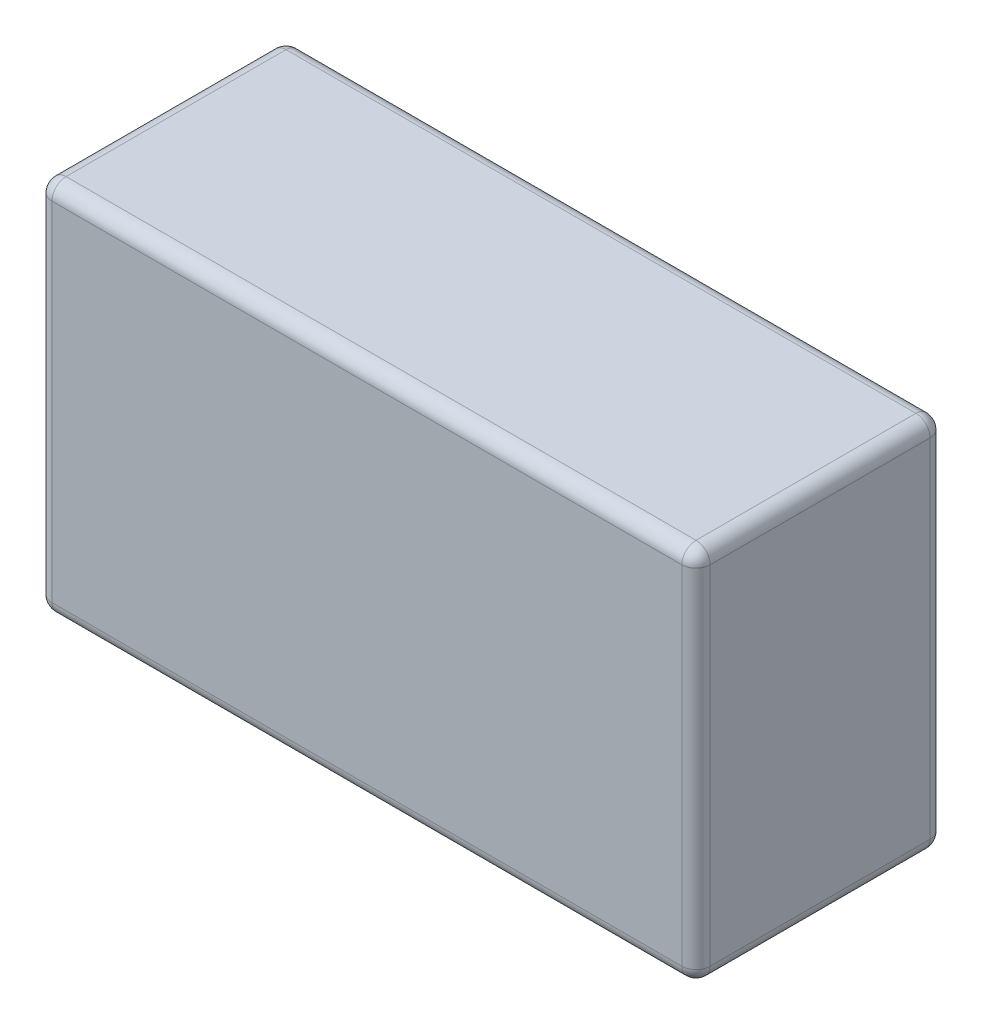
ISO-10303-21;
HEADER;
FILE_DESCRIPTION(('STEP AP214'),'2;1');
FILE_NAME('part.step','',(''),(''),'','','');
FILE_SCHEMA(('AUTOMOTIVE_DESIGN { 1 0 10303 214 1 1 1 1 }'));
ENDSEC;
DATA;
#1=APPLICATION_CONTEXT('core data for automotive mechanical design processes');
#2=APPLICATION_PROTOCOL_DEFINITION('international standard','automotive_design',2000,#1);
#3=PRODUCT_CONTEXT('',#1,'mechanical');
#4=PRODUCT('Part','Part','',(#3));
#5=PRODUCT_RELATED_PRODUCT_CATEGORY('part','',(#4));
#6=PRODUCT_DEFINITION_FORMATION('','',#4);
#7=PRODUCT_DEFINITION_CONTEXT('part definition',#1,'design');
#8=PRODUCT_DEFINITION('design','',#6,#7);
#9=PRODUCT_DEFINITION_SHAPE('','',#8);
#10=(LENGTH_UNIT() NAMED_UNIT(*) SI_UNIT(.MILLI.,.METRE.));
#11=(NAMED_UNIT(*) PLANE_ANGLE_UNIT() SI_UNIT($,.RADIAN.));
#12=(NAMED_UNIT(*) SI_UNIT($,.STERADIAN.) SOLID_ANGLE_UNIT());
#13=UNCERTAINTY_MEASURE_WITH_UNIT(LENGTH_MEASURE(1.E-05),#10,'distance_accuracy_value','');
#14=(GEOMETRIC_REPRESENTATION_CONTEXT(3) GLOBAL_UNCERTAINTY_ASSIGNED_CONTEXT((#13)) GLOBAL_UNIT_ASSIGNED_CONTEXT((#10,
#11,#12)) REPRESENTATION_CONTEXT('',''));
#15=CARTESIAN_POINT('',(0.,0.,0.));
#16=DIRECTION('',(0.,0.,1.));
#17=DIRECTION('',(1.,0.,0.));
#18=AXIS2_PLACEMENT_3D('',#15,#16,#17);
#19=CARTESIAN_POINT('',(0.,0.,17.5));
#20=DIRECTION('',(1.,0.,0.));
#21=DIRECTION('',(0.,0.,-1.));
#22=AXIS2_PLACEMENT_3D('',#19,#20,#21);
#23=PLANE('',#22);
#24=DIRECTION('',(0.,-1.,0.));
#25=VECTOR('',#24,1.);
#26=CARTESIAN_POINT('',(0.,0.,1.));
#27=LINE('',#26,#25);
#28=CARTESIAN_POINT('',(0.,25.5,1.));
#29=VERTEX_POINT('',#28);
#30=CARTESIAN_POINT('',(0.,1.,1.));
#31=VERTEX_POINT('',#30);
#32=EDGE_CURVE('E55',#29,#31,#27,.T.);
#33=ORIENTED_EDGE('',*,*,#32,.T.);
#34=DIRECTION('',(0.,0.,-1.));
#35=VECTOR('',#34,1.);
#36=CARTESIAN_POINT('',(0.,1.,17.5));
#37=LINE('',#36,#35);
#38=CARTESIAN_POINT('',(0.,1.,16.5));
#39=VERTEX_POINT('',#38);
#40=EDGE_CURVE('E11',#31,#39,#37,.F.);
#41=ORIENTED_EDGE('',*,*,#40,.T.);
#42=DIRECTION('',(0.,-1.,0.));
#43=VECTOR('',#42,1.);
#44=CARTESIAN_POINT('',(0.,0.,16.5));
#45=LINE('',#44,#43);
#46=CARTESIAN_POINT('',(0.,25.5,16.5));
#47=VERTEX_POINT('',#46);
#48=EDGE_CURVE('E310',#39,#47,#45,.F.);
#49=ORIENTED_EDGE('',*,*,#48,.T.);
#50=DIRECTION('',(0.,0.,-1.));
#51=VECTOR('',#50,1.);
#52=CARTESIAN_POINT('',(0.,25.5,17.5));
#53=LINE('',#52,#51);
#54=EDGE_CURVE('E307',#47,#29,#53,.T.);
#55=ORIENTED_EDGE('',*,*,#54,.T.);
#56=EDGE_LOOP('',(#33,#41,#49,#55));
#57=FACE_BOUND('',#56,.T.);
#58=DIRECTION('',(0.,-0.0147140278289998,0.999891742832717));
#59=VECTOR('',#58,1.);
#60=CARTESIAN_POINT('',(0.,3.58011191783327,6.48787112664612));
#61=LINE('',#60,#59);
#62=CARTESIAN_POINT('',(0.,3.58011191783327,6.48787112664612));
#63=VERTEX_POINT('',#62);
#64=CARTESIAN_POINT('',(0.,3.52064588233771,10.5288854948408));
#65=VERTEX_POINT('',#64);
#66=EDGE_CURVE('E173',#63,#65,#61,.T.);
#67=ORIENTED_EDGE('',*,*,#66,.F.);
#68=DIRECTION('',(0.,-0.873288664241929,0.487203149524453));
#69=VECTOR('',#68,1.);
#70=CARTESIAN_POINT('',(0.,7.10946603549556,4.51886303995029));
#71=LINE('',#70,#69);
#72=CARTESIAN_POINT('',(0.,7.10946603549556,4.51886303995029));
#73=VERTEX_POINT('',#72);
#74=EDGE_CURVE('E176',#73,#63,#71,.T.);
#75=ORIENTED_EDGE('',*,*,#74,.F.);
#76=DIRECTION('',(0.,-0.85857463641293,-0.512688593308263));
#77=VECTOR('',#76,1.);
#78=CARTESIAN_POINT('',(0.,10.5793541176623,6.59086932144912));
#79=LINE('',#78,#77);
#80=CARTESIAN_POINT('',(0.,10.5793541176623,6.59086932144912));
#81=VERTEX_POINT('',#80);
#82=EDGE_CURVE('E197',#81,#73,#79,.T.);
#83=ORIENTED_EDGE('',*,*,#82,.F.);
#84=DIRECTION('',(0.,0.0147140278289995,-0.999891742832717));
#85=VECTOR('',#84,1.);
#86=CARTESIAN_POINT('',(0.,10.5198880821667,10.6318836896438));
#87=LINE('',#86,#85);
#88=CARTESIAN_POINT('',(0.,10.5198880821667,10.6318836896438));
#89=VERTEX_POINT('',#88);
#90=EDGE_CURVE('E215',#89,#81,#87,.T.);
#91=ORIENTED_EDGE('',*,*,#90,.F.);
#92=DIRECTION('',(0.,0.873288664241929,-0.487203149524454));
#93=VECTOR('',#92,1.);
#94=CARTESIAN_POINT('',(0.,6.99053396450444,12.6008917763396));
#95=LINE('',#94,#93);
#96=CARTESIAN_POINT('',(0.,6.99053396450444,12.6008917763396));
#97=VERTEX_POINT('',#96);
#98=EDGE_CURVE('E219',#97,#89,#95,.T.);
#99=ORIENTED_EDGE('',*,*,#98,.F.);
#100=DIRECTION('',(0.,0.85857463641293,0.512688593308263));
#101=VECTOR('',#100,1.);
#102=CARTESIAN_POINT('',(0.,3.52064588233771,10.5288854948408));
#103=LINE('',#102,#101);
#104=EDGE_CURVE('E179',#65,#97,#103,.T.);
#105=ORIENTED_EDGE('',*,*,#104,.F.);
#106=EDGE_LOOP('',(#67,#75,#83,#91,#99,#105));
#107=FACE_BOUND('',#106,.T.);
#108=CARTESIAN_POINT('',(0.,20.,8.75));
#109=DIRECTION('',(1.,0.,0.));
#110=DIRECTION('',(0.,0.,-1.));
#111=AXIS2_PLACEMENT_3D('',#108,#109,#110);
#112=CIRCLE('',#111,3.5);
#113=CARTESIAN_POINT('',(0.,20.,5.25));
#114=VERTEX_POINT('',#113);
#115=EDGE_CURVE('E238',#114,#114,#112,.F.);
#116=ORIENTED_EDGE('',*,*,#115,.F.);
#117=EDGE_LOOP('',(#116));
#118=FACE_BOUND('',#117,.T.);
#119=ADVANCED_FACE('F45',(#57,#107,#118),#23,.F.);
#120=CARTESIAN_POINT('',(0.,0.,17.5));
#121=DIRECTION('',(0.,1.,0.));
#122=DIRECTION('',(0.,0.,1.));
#123=AXIS2_PLACEMENT_3D('',#120,#121,#122);
#124=PLANE('',#123);
#125=DIRECTION('',(1.,0.,0.));
#126=VECTOR('',#125,1.);
#127=CARTESIAN_POINT('',(46.4,0.,1.));
#128=LINE('',#127,#126);
#129=CARTESIAN_POINT('',(1.,0.,1.));
#130=VERTEX_POINT('',#129);
#131=CARTESIAN_POINT('',(45.4,0.,1.));
#132=VERTEX_POINT('',#131);
#133=EDGE_CURVE('E255',#130,#132,#128,.T.);
#134=ORIENTED_EDGE('',*,*,#133,.T.);
#135=DIRECTION('',(0.,0.,-1.));
#136=VECTOR('',#135,1.);
#137=CARTESIAN_POINT('',(45.4,0.,17.5));
#138=LINE('',#137,#136);
#139=CARTESIAN_POINT('',(45.4,0.,16.5));
#140=VERTEX_POINT('',#139);
#141=EDGE_CURVE('E264',#132,#140,#138,.F.);
#142=ORIENTED_EDGE('',*,*,#141,.T.);
#143=DIRECTION('',(1.,0.,0.));
#144=VECTOR('',#143,1.);
#145=CARTESIAN_POINT('',(0.,0.,16.5));
#146=LINE('',#145,#144);
#147=CARTESIAN_POINT('',(1.,0.,16.5));
#148=VERTEX_POINT('',#147);
#149=EDGE_CURVE('E261',#140,#148,#146,.F.);
#150=ORIENTED_EDGE('',*,*,#149,.T.);
#151=DIRECTION('',(0.,0.,-1.));
#152=VECTOR('',#151,1.);
#153=CARTESIAN_POINT('',(1.,0.,17.5));
#154=LINE('',#153,#152);
#155=EDGE_CURVE('E258',#148,#130,#154,.T.);
#156=ORIENTED_EDGE('',*,*,#155,.T.);
#157=EDGE_LOOP('',(#134,#142,#150,#156));
#158=FACE_BOUND('',#157,.T.);
#159=ADVANCED_FACE('F450',(#158),#124,.F.);
#160=CARTESIAN_POINT('',(46.4,0.,17.5));
#161=DIRECTION('',(-1.,0.,0.));
#162=DIRECTION('',(0.,0.,1.));
#163=AXIS2_PLACEMENT_3D('',#160,#161,#162);
#164=PLANE('',#163);
#165=DIRECTION('',(0.,1.,0.));
#166=VECTOR('',#165,1.);
#167=CARTESIAN_POINT('',(46.4,0.,16.5));
#168=LINE('',#167,#166);
#169=CARTESIAN_POINT('',(46.4,25.5,16.5));
#170=VERTEX_POINT('',#169);
#171=CARTESIAN_POINT('',(46.4,1.,16.5));
#172=VERTEX_POINT('',#171);
#173=EDGE_CURVE('E242',#170,#172,#168,.F.);
#174=ORIENTED_EDGE('',*,*,#173,.T.);
#175=DIRECTION('',(0.,0.,-1.));
#176=VECTOR('',#175,1.);
#177=CARTESIAN_POINT('',(46.4,1.,17.5));
#178=LINE('',#177,#176);
#179=CARTESIAN_POINT('',(46.4,1.,1.));
#180=VERTEX_POINT('',#179);
#181=EDGE_CURVE('E251',#172,#180,#178,.T.);
#182=ORIENTED_EDGE('',*,*,#181,.T.);
#183=DIRECTION('',(0.,1.,0.));
#184=VECTOR('',#183,1.);
#185=CARTESIAN_POINT('',(46.4,26.5,1.));
#186=LINE('',#185,#184);
#187=CARTESIAN_POINT('',(46.4,25.5,1.));
#188=VERTEX_POINT('',#187);
#189=EDGE_CURVE('E248',#180,#188,#186,.T.);
#190=ORIENTED_EDGE('',*,*,#189,.T.);
#191=DIRECTION('',(0.,0.,-1.));
#192=VECTOR('',#191,1.);
#193=CARTESIAN_POINT('',(46.4,25.5,17.5));
#194=LINE('',#193,#192);
#195=EDGE_CURVE('E245',#188,#170,#194,.F.);
#196=ORIENTED_EDGE('',*,*,#195,.T.);
#197=EDGE_LOOP('',(#174,#182,#190,#196));
#198=FACE_BOUND('',#197,.T.);
#199=ADVANCED_FACE('F456',(#198),#164,.F.);
#200=CARTESIAN_POINT('',(0.,26.5,17.5));
#201=DIRECTION('',(0.,-1.,0.));
#202=DIRECTION('',(0.,0.,-1.));
#203=AXIS2_PLACEMENT_3D('',#200,#201,#202);
#204=PLANE('',#203);
#205=DIRECTION('',(-1.,0.,0.));
#206=VECTOR('',#205,1.);
#207=CARTESIAN_POINT('',(0.,26.5,16.5));
#208=LINE('',#207,#206);
#209=CARTESIAN_POINT('',(1.,26.5,16.5));
#210=VERTEX_POINT('',#209);
#211=CARTESIAN_POINT('',(45.4,26.5,16.5));
#212=VERTEX_POINT('',#211);
#213=EDGE_CURVE('E284',#210,#212,#208,.F.);
#214=ORIENTED_EDGE('',*,*,#213,.T.);
#215=DIRECTION('',(0.,0.,-1.));
#216=VECTOR('',#215,1.);
#217=CARTESIAN_POINT('',(45.4,26.5,17.5));
#218=LINE('',#217,#216);
#219=CARTESIAN_POINT('',(45.4,26.5,1.));
#220=VERTEX_POINT('',#219);
#221=EDGE_CURVE('E290',#212,#220,#218,.T.);
#222=ORIENTED_EDGE('',*,*,#221,.T.);
#223=DIRECTION('',(-1.,0.,0.));
#224=VECTOR('',#223,1.);
#225=CARTESIAN_POINT('',(0.,26.5,1.));
#226=LINE('',#225,#224);
#227=CARTESIAN_POINT('',(1.,26.5,1.));
#228=VERTEX_POINT('',#227);
#229=EDGE_CURVE('E287',#220,#228,#226,.T.);
#230=ORIENTED_EDGE('',*,*,#229,.T.);
#231=DIRECTION('',(0.,0.,-1.));
#232=VECTOR('',#231,1.);
#233=CARTESIAN_POINT('',(1.,26.5,17.5));
#234=LINE('',#233,#232);
#235=EDGE_CURVE('E281',#228,#210,#234,.F.);
#236=ORIENTED_EDGE('',*,*,#235,.T.);
#237=EDGE_LOOP('',(#214,#222,#230,#236));
#238=FACE_BOUND('',#237,.T.);
#239=ADVANCED_FACE('F542',(#238),#204,.F.);
#240=CARTESIAN_POINT('',(0.,0.,17.5));
#241=DIRECTION('',(0.,0.,-1.));
#242=DIRECTION('',(-1.,0.,0.));
#243=AXIS2_PLACEMENT_3D('',#240,#241,#242);
#244=PLANE('',#243);
#245=DIRECTION('',(1.,0.,0.));
#246=VECTOR('',#245,1.);
#247=CARTESIAN_POINT('',(0.,1.,17.5));
#248=LINE('',#247,#246);
#249=CARTESIAN_POINT('',(1.,1.,17.5));
#250=VERTEX_POINT('',#249);
#251=CARTESIAN_POINT('',(45.4,1.,17.5));
#252=VERTEX_POINT('',#251);
#253=EDGE_CURVE('E300',#250,#252,#248,.T.);
#254=ORIENTED_EDGE('',*,*,#253,.T.);
#255=DIRECTION('',(0.,1.,0.));
#256=VECTOR('',#255,1.);
#257=CARTESIAN_POINT('',(45.4,0.,17.5));
#258=LINE('',#257,#256);
#259=CARTESIAN_POINT('',(45.4,25.5,17.5));
#260=VERTEX_POINT('',#259);
#261=EDGE_CURVE('E303',#252,#260,#258,.T.);
#262=ORIENTED_EDGE('',*,*,#261,.T.);
#263=DIRECTION('',(-1.,0.,0.));
#264=VECTOR('',#263,1.);
#265=CARTESIAN_POINT('',(0.,25.5,17.5));
#266=LINE('',#265,#264);
#267=CARTESIAN_POINT('',(1.,25.5,17.5));
#268=VERTEX_POINT('',#267);
#269=EDGE_CURVE('E297',#260,#268,#266,.T.);
#270=ORIENTED_EDGE('',*,*,#269,.T.);
#271=DIRECTION('',(0.,-1.,0.));
#272=VECTOR('',#271,1.);
#273=CARTESIAN_POINT('',(1.,0.,17.5));
#274=LINE('',#273,#272);
#275=EDGE_CURVE('E294',#268,#250,#274,.T.);
#276=ORIENTED_EDGE('',*,*,#275,.T.);
#277=EDGE_LOOP('',(#254,#262,#270,#276));
#278=FACE_BOUND('',#277,.T.);
#279=ADVANCED_FACE('F555',(#278),#244,.F.);
#280=CARTESIAN_POINT('',(0.,0.,0.));
#281=DIRECTION('',(0.,0.,-1.));
#282=DIRECTION('',(-1.,0.,0.));
#283=AXIS2_PLACEMENT_3D('',#280,#281,#282);
#284=PLANE('',#283);
#285=DIRECTION('',(-1.,0.,0.));
#286=VECTOR('',#285,1.);
#287=CARTESIAN_POINT('',(46.4,25.5,0.));
#288=LINE('',#287,#286);
#289=CARTESIAN_POINT('',(1.,25.5,0.));
#290=VERTEX_POINT('',#289);
#291=CARTESIAN_POINT('',(45.4,25.5,0.));
#292=VERTEX_POINT('',#291);
#293=EDGE_CURVE('E268',#290,#292,#288,.F.);
#294=ORIENTED_EDGE('',*,*,#293,.T.);
#295=DIRECTION('',(0.,1.,0.));
#296=VECTOR('',#295,1.);
#297=CARTESIAN_POINT('',(45.4,0.,0.));
#298=LINE('',#297,#296);
#299=CARTESIAN_POINT('',(45.4,1.,0.));
#300=VERTEX_POINT('',#299);
#301=EDGE_CURVE('E277',#292,#300,#298,.F.);
#302=ORIENTED_EDGE('',*,*,#301,.T.);
#303=DIRECTION('',(1.,0.,0.));
#304=VECTOR('',#303,1.);
#305=CARTESIAN_POINT('',(0.,1.,0.));
#306=LINE('',#305,#304);
#307=CARTESIAN_POINT('',(1.,1.,0.));
#308=VERTEX_POINT('',#307);
#309=EDGE_CURVE('E274',#300,#308,#306,.F.);
#310=ORIENTED_EDGE('',*,*,#309,.T.);
#311=DIRECTION('',(0.,-1.,0.));
#312=VECTOR('',#311,1.);
#313=CARTESIAN_POINT('',(1.,26.5,0.));
#314=LINE('',#313,#312);
#315=EDGE_CURVE('E271',#308,#290,#314,.F.);
#316=ORIENTED_EDGE('',*,*,#315,.T.);
#317=EDGE_LOOP('',(#294,#302,#310,#316));
#318=FACE_BOUND('',#317,.T.);
#319=ADVANCED_FACE('F572',(#318),#284,.T.);
#320=CARTESIAN_POINT('',(-2.,3.58011191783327,6.48787112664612));
#321=DIRECTION('',(0.,0.999891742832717,0.0147140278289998));
#322=DIRECTION('',(0.,-0.0147140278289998,0.999891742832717));
#323=AXIS2_PLACEMENT_3D('',#320,#321,#322);
#324=PLANE('',#323);
#325=ORIENTED_EDGE('',*,*,#66,.T.);
#326=DIRECTION('',(1.,0.,0.));
#327=VECTOR('',#326,1.);
#328=CARTESIAN_POINT('',(-2.,3.52064588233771,10.5288854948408));
#329=LINE('',#328,#327);
#330=CARTESIAN_POINT('',(-2.,3.52064588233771,10.5288854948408));
#331=VERTEX_POINT('',#330);
#332=EDGE_CURVE('E403',#331,#65,#329,.T.);
#333=ORIENTED_EDGE('',*,*,#332,.F.);
#334=DIRECTION('',(0.,-0.0147140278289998,0.999891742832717));
#335=VECTOR('',#334,1.);
#336=CARTESIAN_POINT('',(-2.,3.58011191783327,6.48787112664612));
#337=LINE('',#336,#335);
#338=CARTESIAN_POINT('',(-2.,3.58011191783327,6.48787112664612));
#339=VERTEX_POINT('',#338);
#340=EDGE_CURVE('E198',#339,#331,#337,.T.);
#341=ORIENTED_EDGE('',*,*,#340,.F.);
#342=DIRECTION('',(1.,0.,0.));
#343=VECTOR('',#342,1.);
#344=CARTESIAN_POINT('',(-2.,3.58011191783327,6.48787112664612));
#345=LINE('',#344,#343);
#346=EDGE_CURVE('E192',#339,#63,#345,.T.);
#347=ORIENTED_EDGE('',*,*,#346,.T.);
#348=EDGE_LOOP('',(#325,#333,#341,#347));
#349=FACE_BOUND('',#348,.T.);
#350=ADVANCED_FACE('F200',(#349),#324,.F.);
#351=CARTESIAN_POINT('',(-2.,3.52064588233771,10.5288854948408));
#352=DIRECTION('',(0.,0.512688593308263,-0.85857463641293));
#353=DIRECTION('',(0.,0.85857463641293,0.512688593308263));
#354=AXIS2_PLACEMENT_3D('',#351,#352,#353);
#355=PLANE('',#354);
#356=ORIENTED_EDGE('',*,*,#104,.T.);
#357=DIRECTION('',(1.,0.,0.));
#358=VECTOR('',#357,1.);
#359=CARTESIAN_POINT('',(-2.,6.99053396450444,12.6008917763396));
#360=LINE('',#359,#358);
#361=CARTESIAN_POINT('',(-2.,6.99053396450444,12.6008917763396));
#362=VERTEX_POINT('',#361);
#363=EDGE_CURVE('E409',#362,#97,#360,.T.);
#364=ORIENTED_EDGE('',*,*,#363,.F.);
#365=DIRECTION('',(0.,0.85857463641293,0.512688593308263));
#366=VECTOR('',#365,1.);
#367=CARTESIAN_POINT('',(-2.,3.52064588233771,10.5288854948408));
#368=LINE('',#367,#366);
#369=EDGE_CURVE('E233',#331,#362,#368,.T.);
#370=ORIENTED_EDGE('',*,*,#369,.F.);
#371=ORIENTED_EDGE('',*,*,#332,.T.);
#372=EDGE_LOOP('',(#356,#364,#370,#371));
#373=FACE_BOUND('',#372,.T.);
#374=ADVANCED_FACE('F434',(#373),#355,.F.);
#375=CARTESIAN_POINT('',(-2.,6.99053396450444,12.6008917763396));
#376=DIRECTION('',(0.,-0.487203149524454,-0.873288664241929));
#377=DIRECTION('',(0.,0.873288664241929,-0.487203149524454));
#378=AXIS2_PLACEMENT_3D('',#375,#376,#377);
#379=PLANE('',#378);
#380=ORIENTED_EDGE('',*,*,#98,.T.);
#381=DIRECTION('',(1.,0.,0.));
#382=VECTOR('',#381,1.);
#383=CARTESIAN_POINT('',(-2.,10.5198880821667,10.6318836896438));
#384=LINE('',#383,#382);
#385=CARTESIAN_POINT('',(-2.,10.5198880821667,10.6318836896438));
#386=VERTEX_POINT('',#385);
#387=EDGE_CURVE('E414',#386,#89,#384,.T.);
#388=ORIENTED_EDGE('',*,*,#387,.F.);
#389=DIRECTION('',(0.,0.873288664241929,-0.487203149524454));
#390=VECTOR('',#389,1.);
#391=CARTESIAN_POINT('',(-2.,6.99053396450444,12.6008917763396));
#392=LINE('',#391,#390);
#393=EDGE_CURVE('E230',#362,#386,#392,.T.);
#394=ORIENTED_EDGE('',*,*,#393,.F.);
#395=ORIENTED_EDGE('',*,*,#363,.T.);
#396=EDGE_LOOP('',(#380,#388,#394,#395));
#397=FACE_BOUND('',#396,.T.);
#398=ADVANCED_FACE('F431',(#397),#379,.F.);
#399=CARTESIAN_POINT('',(-2.,10.5198880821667,10.6318836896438));
#400=DIRECTION('',(0.,-0.999891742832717,-0.0147140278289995));
#401=DIRECTION('',(0.,0.0147140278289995,-0.999891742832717));
#402=AXIS2_PLACEMENT_3D('',#399,#400,#401);
#403=PLANE('',#402);
#404=ORIENTED_EDGE('',*,*,#90,.T.);
#405=DIRECTION('',(1.,0.,0.));
#406=VECTOR('',#405,1.);
#407=CARTESIAN_POINT('',(-2.,10.5793541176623,6.59086932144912));
#408=LINE('',#407,#406);
#409=CARTESIAN_POINT('',(-2.,10.5793541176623,6.59086932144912));
#410=VERTEX_POINT('',#409);
#411=EDGE_CURVE('E209',#410,#81,#408,.T.);
#412=ORIENTED_EDGE('',*,*,#411,.F.);
#413=DIRECTION('',(0.,0.0147140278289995,-0.999891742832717));
#414=VECTOR('',#413,1.);
#415=CARTESIAN_POINT('',(-2.,10.5198880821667,10.6318836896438));
#416=LINE('',#415,#414);
#417=EDGE_CURVE('E227',#386,#410,#416,.T.);
#418=ORIENTED_EDGE('',*,*,#417,.F.);
#419=ORIENTED_EDGE('',*,*,#387,.T.);
#420=EDGE_LOOP('',(#404,#412,#418,#419));
#421=FACE_BOUND('',#420,.T.);
#422=ADVANCED_FACE('F428',(#421),#403,.F.);
#423=CARTESIAN_POINT('',(-2.,10.5793541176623,6.59086932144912));
#424=DIRECTION('',(0.,-0.512688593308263,0.85857463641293));
#425=DIRECTION('',(0.,-0.85857463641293,-0.512688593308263));
#426=AXIS2_PLACEMENT_3D('',#423,#424,#425);
#427=PLANE('',#426);
#428=ORIENTED_EDGE('',*,*,#82,.T.);
#429=DIRECTION('',(1.,0.,0.));
#430=VECTOR('',#429,1.);
#431=CARTESIAN_POINT('',(-2.,7.10946603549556,4.51886303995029));
#432=LINE('',#431,#430);
#433=CARTESIAN_POINT('',(-2.,7.10946603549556,4.51886303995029));
#434=VERTEX_POINT('',#433);
#435=EDGE_CURVE('E195',#434,#73,#432,.T.);
#436=ORIENTED_EDGE('',*,*,#435,.F.);
#437=DIRECTION('',(0.,-0.85857463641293,-0.512688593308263));
#438=VECTOR('',#437,1.);
#439=CARTESIAN_POINT('',(-2.,10.5793541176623,6.59086932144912));
#440=LINE('',#439,#438);
#441=EDGE_CURVE('E207',#410,#434,#440,.T.);
#442=ORIENTED_EDGE('',*,*,#441,.F.);
#443=ORIENTED_EDGE('',*,*,#411,.T.);
#444=EDGE_LOOP('',(#428,#436,#442,#443));
#445=FACE_BOUND('',#444,.T.);
#446=ADVANCED_FACE('F425',(#445),#427,.F.);
#447=CARTESIAN_POINT('',(-2.,7.10946603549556,4.51886303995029));
#448=DIRECTION('',(0.,0.487203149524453,0.873288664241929));
#449=DIRECTION('',(0.,-0.873288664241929,0.487203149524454));
#450=AXIS2_PLACEMENT_3D('',#447,#448,#449);
#451=PLANE('',#450);
#452=ORIENTED_EDGE('',*,*,#74,.T.);
#453=ORIENTED_EDGE('',*,*,#346,.F.);
#454=DIRECTION('',(0.,-0.873288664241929,0.487203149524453));
#455=VECTOR('',#454,1.);
#456=CARTESIAN_POINT('',(-2.,7.10946603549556,4.51886303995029));
#457=LINE('',#456,#455);
#458=EDGE_CURVE('E203',#434,#339,#457,.T.);
#459=ORIENTED_EDGE('',*,*,#458,.F.);
#460=ORIENTED_EDGE('',*,*,#435,.T.);
#461=EDGE_LOOP('',(#452,#453,#459,#460));
#462=FACE_BOUND('',#461,.T.);
#463=ADVANCED_FACE('F190',(#462),#451,.F.);
#464=CARTESIAN_POINT('',(-2.,0.,0.));
#465=DIRECTION('',(-1.,0.,0.));
#466=DIRECTION('',(0.,0.,1.));
#467=AXIS2_PLACEMENT_3D('',#464,#465,#466);
#468=PLANE('',#467);
#469=ORIENTED_EDGE('',*,*,#340,.T.);
#470=ORIENTED_EDGE('',*,*,#369,.T.);
#471=ORIENTED_EDGE('',*,*,#393,.T.);
#472=ORIENTED_EDGE('',*,*,#417,.T.);
#473=ORIENTED_EDGE('',*,*,#441,.T.);
#474=ORIENTED_EDGE('',*,*,#458,.T.);
#475=EDGE_LOOP('',(#469,#470,#471,#472,#473,#474));
#476=FACE_BOUND('',#475,.T.);
#477=ADVANCED_FACE('F436',(#476),#468,.T.);
#478=CARTESIAN_POINT('',(-2.,20.,8.75));
#479=DIRECTION('',(1.,0.,0.));
#480=DIRECTION('',(0.,0.,-1.));
#481=AXIS2_PLACEMENT_3D('',#478,#479,#480);
#482=CYLINDRICAL_SURFACE('',#481,3.5);
#483=CARTESIAN_POINT('',(-2.,20.,8.75));
#484=DIRECTION('',(-1.,0.,0.));
#485=DIRECTION('',(0.,0.,1.));
#486=AXIS2_PLACEMENT_3D('',#483,#484,#485);
#487=CIRCLE('',#486,3.5);
#488=CARTESIAN_POINT('',(-2.,20.,12.25));
#489=VERTEX_POINT('',#488);
#490=EDGE_CURVE('E185',#489,#489,#487,.T.);
#491=ORIENTED_EDGE('',*,*,#490,.F.);
#492=EDGE_LOOP('',(#491));
#493=FACE_BOUND('',#492,.T.);
#494=ORIENTED_EDGE('',*,*,#115,.T.);
#495=EDGE_LOOP('',(#494));
#496=FACE_BOUND('',#495,.T.);
#497=ADVANCED_FACE('F438',(#493,#496),#482,.T.);
#498=CARTESIAN_POINT('',(-2.,20.,8.75));
#499=DIRECTION('',(-1.,0.,0.));
#500=DIRECTION('',(0.,0.,1.));
#501=AXIS2_PLACEMENT_3D('',#498,#499,#500);
#502=PLANE('',#501);
#503=ORIENTED_EDGE('',*,*,#490,.T.);
#504=EDGE_LOOP('',(#503));
#505=FACE_BOUND('',#504,.T.);
#506=ADVANCED_FACE('F444',(#505),#502,.T.);
#507=CARTESIAN_POINT('',(1.,25.5,17.5));
#508=DIRECTION('',(0.,0.,-1.));
#509=DIRECTION('',(-1.,0.,0.));
#510=AXIS2_PLACEMENT_3D('',#507,#508,#509);
#511=CYLINDRICAL_SURFACE('',#510,1.);
#512=CARTESIAN_POINT('',(1.,25.5,16.5));
#513=DIRECTION('',(0.,0.,1.));
#514=DIRECTION('',(1.,0.,0.));
#515=AXIS2_PLACEMENT_3D('',#512,#513,#514);
#516=CIRCLE('',#515,1.);
#517=EDGE_CURVE('E49',#210,#47,#516,.T.);
#518=ORIENTED_EDGE('',*,*,#517,.F.);
#519=ORIENTED_EDGE('',*,*,#235,.F.);
#520=CARTESIAN_POINT('',(1.,25.5,1.));
#521=DIRECTION('',(0.,0.,-1.));
#522=DIRECTION('',(-1.,0.,0.));
#523=AXIS2_PLACEMENT_3D('',#520,#521,#522);
#524=CIRCLE('',#523,1.);
#525=EDGE_CURVE('E394',#29,#228,#524,.T.);
#526=ORIENTED_EDGE('',*,*,#525,.F.);
#527=ORIENTED_EDGE('',*,*,#54,.F.);
#528=EDGE_LOOP('',(#518,#519,#526,#527));
#529=FACE_BOUND('',#528,.T.);
#530=ADVANCED_FACE('F47',(#529),#511,.T.);
#531=CARTESIAN_POINT('',(1.,25.5,16.5));
#532=DIRECTION('',(-1.,0.,0.));
#533=DIRECTION('',(0.,0.,1.));
#534=AXIS2_PLACEMENT_3D('',#531,#532,#533);
#535=SPHERICAL_SURFACE('',#534,1.);
#536=CARTESIAN_POINT('',(1.,25.5,16.5));
#537=DIRECTION('',(-1.,0.,0.));
#538=DIRECTION('',(0.,0.,1.));
#539=AXIS2_PLACEMENT_3D('',#536,#537,#538);
#540=CIRCLE('',#539,1.);
#541=EDGE_CURVE('E387',#210,#268,#540,.F.);
#542=ORIENTED_EDGE('',*,*,#541,.F.);
#543=ORIENTED_EDGE('',*,*,#517,.T.);
#544=CARTESIAN_POINT('',(1.,25.5,16.5));
#545=DIRECTION('',(0.,1.,0.));
#546=DIRECTION('',(0.,0.,1.));
#547=AXIS2_PLACEMENT_3D('',#544,#545,#546);
#548=CIRCLE('',#547,1.);
#549=EDGE_CURVE('E391',#268,#47,#548,.F.);
#550=ORIENTED_EDGE('',*,*,#549,.F.);
#551=EDGE_LOOP('',(#542,#543,#550));
#552=FACE_BOUND('',#551,.T.);
#553=ADVANCED_FACE('F530',(#552),#535,.T.);
#554=CARTESIAN_POINT('',(1.,25.5,1.));
#555=DIRECTION('',(0.,1.,0.));
#556=DIRECTION('',(0.,0.,1.));
#557=AXIS2_PLACEMENT_3D('',#554,#555,#556);
#558=SPHERICAL_SURFACE('',#557,1.);
#559=CARTESIAN_POINT('',(1.,25.5,1.));
#560=DIRECTION('',(0.,1.,0.));
#561=DIRECTION('',(0.,0.,1.));
#562=AXIS2_PLACEMENT_3D('',#559,#560,#561);
#563=CIRCLE('',#562,1.);
#564=EDGE_CURVE('E379',#29,#290,#563,.F.);
#565=ORIENTED_EDGE('',*,*,#564,.F.);
#566=ORIENTED_EDGE('',*,*,#525,.T.);
#567=CARTESIAN_POINT('',(1.,25.5,1.));
#568=DIRECTION('',(-1.,0.,0.));
#569=DIRECTION('',(0.,0.,1.));
#570=AXIS2_PLACEMENT_3D('',#567,#568,#569);
#571=CIRCLE('',#570,1.);
#572=EDGE_CURVE('E383',#290,#228,#571,.F.);
#573=ORIENTED_EDGE('',*,*,#572,.F.);
#574=EDGE_LOOP('',(#565,#566,#573));
#575=FACE_BOUND('',#574,.T.);
#576=ADVANCED_FACE('F527',(#575),#558,.T.);
#577=CARTESIAN_POINT('',(1.,0.,16.5));
#578=DIRECTION('',(0.,-1.,0.));
#579=DIRECTION('',(0.,0.,-1.));
#580=AXIS2_PLACEMENT_3D('',#577,#578,#579);
#581=CYLINDRICAL_SURFACE('',#580,1.);
#582=ORIENTED_EDGE('',*,*,#549,.T.);
#583=ORIENTED_EDGE('',*,*,#48,.F.);
#584=CARTESIAN_POINT('',(1.,1.,16.5));
#585=DIRECTION('',(0.,-1.,0.));
#586=DIRECTION('',(0.,0.,-1.));
#587=AXIS2_PLACEMENT_3D('',#584,#585,#586);
#588=CIRCLE('',#587,1.);
#589=EDGE_CURVE('E69',#250,#39,#588,.T.);
#590=ORIENTED_EDGE('',*,*,#589,.F.);
#591=ORIENTED_EDGE('',*,*,#275,.F.);
#592=EDGE_LOOP('',(#582,#583,#590,#591));
#593=FACE_BOUND('',#592,.T.);
#594=ADVANCED_FACE('F523',(#593),#581,.T.);
#595=CARTESIAN_POINT('',(0.,25.5,16.5));
#596=DIRECTION('',(-1.,0.,0.));
#597=DIRECTION('',(0.,0.,1.));
#598=AXIS2_PLACEMENT_3D('',#595,#596,#597);
#599=CYLINDRICAL_SURFACE('',#598,1.);
#600=ORIENTED_EDGE('',*,*,#541,.T.);
#601=ORIENTED_EDGE('',*,*,#269,.F.);
#602=CARTESIAN_POINT('',(45.4,25.5,16.5));
#603=DIRECTION('',(1.,0.,0.));
#604=DIRECTION('',(0.,0.,-1.));
#605=AXIS2_PLACEMENT_3D('',#602,#603,#604);
#606=CIRCLE('',#605,1.);
#607=EDGE_CURVE('E370',#212,#260,#606,.T.);
#608=ORIENTED_EDGE('',*,*,#607,.F.);
#609=ORIENTED_EDGE('',*,*,#213,.F.);
#610=EDGE_LOOP('',(#600,#601,#608,#609));
#611=FACE_BOUND('',#610,.T.);
#612=ADVANCED_FACE('F519',(#611),#599,.T.);
#613=CARTESIAN_POINT('',(45.4,25.5,17.5));
#614=DIRECTION('',(0.,0.,-1.));
#615=DIRECTION('',(-1.,0.,0.));
#616=AXIS2_PLACEMENT_3D('',#613,#614,#615);
#617=CYLINDRICAL_SURFACE('',#616,1.);
#618=CARTESIAN_POINT('',(45.4,25.5,1.));
#619=DIRECTION('',(0.,0.,-1.));
#620=DIRECTION('',(-1.,0.,0.));
#621=AXIS2_PLACEMENT_3D('',#618,#619,#620);
#622=CIRCLE('',#621,1.);
#623=EDGE_CURVE('E362',#220,#188,#622,.T.);
#624=ORIENTED_EDGE('',*,*,#623,.F.);
#625=ORIENTED_EDGE('',*,*,#221,.F.);
#626=CARTESIAN_POINT('',(45.4,25.5,16.5));
#627=DIRECTION('',(0.,0.,1.));
#628=DIRECTION('',(1.,0.,0.));
#629=AXIS2_PLACEMENT_3D('',#626,#627,#628);
#630=CIRCLE('',#629,1.);
#631=EDGE_CURVE('E366',#170,#212,#630,.T.);
#632=ORIENTED_EDGE('',*,*,#631,.F.);
#633=ORIENTED_EDGE('',*,*,#195,.F.);
#634=EDGE_LOOP('',(#624,#625,#632,#633));
#635=FACE_BOUND('',#634,.T.);
#636=ADVANCED_FACE('F515',(#635),#617,.T.);
#637=CARTESIAN_POINT('',(0.,25.5,1.));
#638=DIRECTION('',(1.,0.,0.));
#639=DIRECTION('',(0.,0.,-1.));
#640=AXIS2_PLACEMENT_3D('',#637,#638,#639);
#641=CYLINDRICAL_SURFACE('',#640,1.);
#642=ORIENTED_EDGE('',*,*,#572,.T.);
#643=ORIENTED_EDGE('',*,*,#229,.F.);
#644=CARTESIAN_POINT('',(45.4,25.5,1.));
#645=DIRECTION('',(1.,0.,0.));
#646=DIRECTION('',(0.,0.,-1.));
#647=AXIS2_PLACEMENT_3D('',#644,#645,#646);
#648=CIRCLE('',#647,1.);
#649=EDGE_CURVE('E359',#292,#220,#648,.T.);
#650=ORIENTED_EDGE('',*,*,#649,.F.);
#651=ORIENTED_EDGE('',*,*,#293,.F.);
#652=EDGE_LOOP('',(#642,#643,#650,#651));
#653=FACE_BOUND('',#652,.T.);
#654=ADVANCED_FACE('F511',(#653),#641,.T.);
#655=CARTESIAN_POINT('',(1.,0.,1.));
#656=DIRECTION('',(0.,1.,0.));
#657=DIRECTION('',(0.,0.,1.));
#658=AXIS2_PLACEMENT_3D('',#655,#656,#657);
#659=CYLINDRICAL_SURFACE('',#658,1.);
#660=ORIENTED_EDGE('',*,*,#564,.T.);
#661=ORIENTED_EDGE('',*,*,#315,.F.);
#662=CARTESIAN_POINT('',(1.,1.,1.));
#663=DIRECTION('',(0.,-1.,0.));
#664=DIRECTION('',(0.,0.,-1.));
#665=AXIS2_PLACEMENT_3D('',#662,#663,#664);
#666=CIRCLE('',#665,1.);
#667=EDGE_CURVE('E355',#31,#308,#666,.T.);
#668=ORIENTED_EDGE('',*,*,#667,.F.);
#669=ORIENTED_EDGE('',*,*,#32,.F.);
#670=EDGE_LOOP('',(#660,#661,#668,#669));
#671=FACE_BOUND('',#670,.T.);
#672=ADVANCED_FACE('F507',(#671),#659,.T.);
#673=CARTESIAN_POINT('',(1.,1.,17.5));
#674=DIRECTION('',(0.,0.,-1.));
#675=DIRECTION('',(-1.,0.,0.));
#676=AXIS2_PLACEMENT_3D('',#673,#674,#675);
#677=CYLINDRICAL_SURFACE('',#676,1.);
#678=CARTESIAN_POINT('',(1.,1.,16.5));
#679=DIRECTION('',(0.,0.,1.));
#680=DIRECTION('',(1.,0.,0.));
#681=AXIS2_PLACEMENT_3D('',#678,#679,#680);
#682=CIRCLE('',#681,1.);
#683=EDGE_CURVE('E376',#39,#148,#682,.T.);
#684=ORIENTED_EDGE('',*,*,#683,.F.);
#685=ORIENTED_EDGE('',*,*,#40,.F.);
#686=CARTESIAN_POINT('',(1.,1.,1.));
#687=DIRECTION('',(0.,0.,-1.));
#688=DIRECTION('',(-1.,0.,0.));
#689=AXIS2_PLACEMENT_3D('',#686,#687,#688);
#690=CIRCLE('',#689,1.);
#691=EDGE_CURVE('E351',#130,#31,#690,.T.);
#692=ORIENTED_EDGE('',*,*,#691,.F.);
#693=ORIENTED_EDGE('',*,*,#155,.F.);
#694=EDGE_LOOP('',(#684,#685,#692,#693));
#695=FACE_BOUND('',#694,.T.);
#696=ADVANCED_FACE('F504',(#695),#677,.T.);
#697=CARTESIAN_POINT('',(1.,1.,16.5));
#698=DIRECTION('',(-1.,0.,0.));
#699=DIRECTION('',(0.,0.,1.));
#700=AXIS2_PLACEMENT_3D('',#697,#698,#699);
#701=SPHERICAL_SURFACE('',#700,1.);
#702=ORIENTED_EDGE('',*,*,#589,.T.);
#703=ORIENTED_EDGE('',*,*,#683,.T.);
#704=CARTESIAN_POINT('',(1.,1.,16.5));
#705=DIRECTION('',(-1.,0.,0.));
#706=DIRECTION('',(0.,0.,1.));
#707=AXIS2_PLACEMENT_3D('',#704,#705,#706);
#708=CIRCLE('',#707,1.);
#709=EDGE_CURVE('E347',#250,#148,#708,.F.);
#710=ORIENTED_EDGE('',*,*,#709,.F.);
#711=EDGE_LOOP('',(#702,#703,#710));
#712=FACE_BOUND('',#711,.T.);
#713=ADVANCED_FACE('F500',(#712),#701,.T.);
#714=CARTESIAN_POINT('',(45.4,25.5,16.5));
#715=DIRECTION('',(0.,1.,0.));
#716=DIRECTION('',(0.,0.,1.));
#717=AXIS2_PLACEMENT_3D('',#714,#715,#716);
#718=SPHERICAL_SURFACE('',#717,1.);
#719=ORIENTED_EDGE('',*,*,#631,.T.);
#720=ORIENTED_EDGE('',*,*,#607,.T.);
#721=CARTESIAN_POINT('',(45.4,25.5,16.5));
#722=DIRECTION('',(0.,1.,0.));
#723=DIRECTION('',(0.,0.,1.));
#724=AXIS2_PLACEMENT_3D('',#721,#722,#723);
#725=CIRCLE('',#724,1.);
#726=EDGE_CURVE('E344',#170,#260,#725,.F.);
#727=ORIENTED_EDGE('',*,*,#726,.F.);
#728=EDGE_LOOP('',(#719,#720,#727));
#729=FACE_BOUND('',#728,.T.);
#730=ADVANCED_FACE('F496',(#729),#718,.T.);
#731=CARTESIAN_POINT('',(45.4,25.5,1.));
#732=DIRECTION('',(0.,1.,0.));
#733=DIRECTION('',(0.,0.,1.));
#734=AXIS2_PLACEMENT_3D('',#731,#732,#733);
#735=SPHERICAL_SURFACE('',#734,1.);
#736=ORIENTED_EDGE('',*,*,#649,.T.);
#737=ORIENTED_EDGE('',*,*,#623,.T.);
#738=CARTESIAN_POINT('',(45.4,25.5,1.));
#739=DIRECTION('',(0.,1.,0.));
#740=DIRECTION('',(0.,0.,1.));
#741=AXIS2_PLACEMENT_3D('',#738,#739,#740);
#742=CIRCLE('',#741,1.);
#743=EDGE_CURVE('E340',#292,#188,#742,.F.);
#744=ORIENTED_EDGE('',*,*,#743,.F.);
#745=EDGE_LOOP('',(#736,#737,#744));
#746=FACE_BOUND('',#745,.T.);
#747=ADVANCED_FACE('F492',(#746),#735,.T.);
#748=CARTESIAN_POINT('',(1.,1.,1.));
#749=DIRECTION('',(-1.,0.,0.));
#750=DIRECTION('',(0.,0.,1.));
#751=AXIS2_PLACEMENT_3D('',#748,#749,#750);
#752=SPHERICAL_SURFACE('',#751,1.);
#753=ORIENTED_EDGE('',*,*,#691,.T.);
#754=ORIENTED_EDGE('',*,*,#667,.T.);
#755=CARTESIAN_POINT('',(1.,1.,1.));
#756=DIRECTION('',(-1.,0.,0.));
#757=DIRECTION('',(0.,0.,1.));
#758=AXIS2_PLACEMENT_3D('',#755,#756,#757);
#759=CIRCLE('',#758,1.);
#760=EDGE_CURVE('E336',#130,#308,#759,.F.);
#761=ORIENTED_EDGE('',*,*,#760,.F.);
#762=EDGE_LOOP('',(#753,#754,#761));
#763=FACE_BOUND('',#762,.T.);
#764=ADVANCED_FACE('F488',(#763),#752,.T.);
#765=CARTESIAN_POINT('',(0.,1.,16.5));
#766=DIRECTION('',(1.,0.,0.));
#767=DIRECTION('',(0.,0.,-1.));
#768=AXIS2_PLACEMENT_3D('',#765,#766,#767);
#769=CYLINDRICAL_SURFACE('',#768,1.);
#770=ORIENTED_EDGE('',*,*,#709,.T.);
#771=ORIENTED_EDGE('',*,*,#149,.F.);
#772=CARTESIAN_POINT('',(45.4,1.,16.5));
#773=DIRECTION('',(1.,0.,0.));
#774=DIRECTION('',(0.,0.,-1.));
#775=AXIS2_PLACEMENT_3D('',#772,#773,#774);
#776=CIRCLE('',#775,1.);
#777=EDGE_CURVE('E332',#252,#140,#776,.T.);
#778=ORIENTED_EDGE('',*,*,#777,.F.);
#779=ORIENTED_EDGE('',*,*,#253,.F.);
#780=EDGE_LOOP('',(#770,#771,#778,#779));
#781=FACE_BOUND('',#780,.T.);
#782=ADVANCED_FACE('F484',(#781),#769,.T.);
#783=CARTESIAN_POINT('',(45.4,0.,16.5));
#784=DIRECTION('',(0.,1.,0.));
#785=DIRECTION('',(0.,0.,1.));
#786=AXIS2_PLACEMENT_3D('',#783,#784,#785);
#787=CYLINDRICAL_SURFACE('',#786,1.);
#788=ORIENTED_EDGE('',*,*,#726,.T.);
#789=ORIENTED_EDGE('',*,*,#261,.F.);
#790=CARTESIAN_POINT('',(45.4,1.,16.5));
#791=DIRECTION('',(0.,-1.,0.));
#792=DIRECTION('',(0.,0.,-1.));
#793=AXIS2_PLACEMENT_3D('',#790,#791,#792);
#794=CIRCLE('',#793,1.);
#795=EDGE_CURVE('E328',#172,#252,#794,.T.);
#796=ORIENTED_EDGE('',*,*,#795,.F.);
#797=ORIENTED_EDGE('',*,*,#173,.F.);
#798=EDGE_LOOP('',(#788,#789,#796,#797));
#799=FACE_BOUND('',#798,.T.);
#800=ADVANCED_FACE('F480',(#799),#787,.T.);
#801=CARTESIAN_POINT('',(45.4,0.,1.));
#802=DIRECTION('',(0.,-1.,0.));
#803=DIRECTION('',(0.,0.,-1.));
#804=AXIS2_PLACEMENT_3D('',#801,#802,#803);
#805=CYLINDRICAL_SURFACE('',#804,1.);
#806=ORIENTED_EDGE('',*,*,#743,.T.);
#807=ORIENTED_EDGE('',*,*,#189,.F.);
#808=CARTESIAN_POINT('',(45.4,1.,1.));
#809=DIRECTION('',(0.,-1.,0.));
#810=DIRECTION('',(0.,0.,-1.));
#811=AXIS2_PLACEMENT_3D('',#808,#809,#810);
#812=CIRCLE('',#811,1.);
#813=EDGE_CURVE('E324',#300,#180,#812,.T.);
#814=ORIENTED_EDGE('',*,*,#813,.F.);
#815=ORIENTED_EDGE('',*,*,#301,.F.);
#816=EDGE_LOOP('',(#806,#807,#814,#815));
#817=FACE_BOUND('',#816,.T.);
#818=ADVANCED_FACE('F476',(#817),#805,.T.);
#819=CARTESIAN_POINT('',(0.,1.,1.));
#820=DIRECTION('',(-1.,0.,0.));
#821=DIRECTION('',(0.,0.,1.));
#822=AXIS2_PLACEMENT_3D('',#819,#820,#821);
#823=CYLINDRICAL_SURFACE('',#822,1.);
#824=ORIENTED_EDGE('',*,*,#760,.T.);
#825=ORIENTED_EDGE('',*,*,#309,.F.);
#826=CARTESIAN_POINT('',(45.4,1.,1.));
#827=DIRECTION('',(1.,0.,0.));
#828=DIRECTION('',(0.,0.,-1.));
#829=AXIS2_PLACEMENT_3D('',#826,#827,#828);
#830=CIRCLE('',#829,1.);
#831=EDGE_CURVE('E321',#132,#300,#830,.T.);
#832=ORIENTED_EDGE('',*,*,#831,.F.);
#833=ORIENTED_EDGE('',*,*,#133,.F.);
#834=EDGE_LOOP('',(#824,#825,#832,#833));
#835=FACE_BOUND('',#834,.T.);
#836=ADVANCED_FACE('F472',(#835),#823,.T.);
#837=CARTESIAN_POINT('',(45.4,1.,16.5));
#838=DIRECTION('',(0.,0.,1.));
#839=DIRECTION('',(1.,0.,0.));
#840=AXIS2_PLACEMENT_3D('',#837,#838,#839);
#841=SPHERICAL_SURFACE('',#840,1.);
#842=ORIENTED_EDGE('',*,*,#795,.T.);
#843=ORIENTED_EDGE('',*,*,#777,.T.);
#844=CARTESIAN_POINT('',(45.4,1.,16.5));
#845=DIRECTION('',(0.,0.,1.));
#846=DIRECTION('',(1.,0.,0.));
#847=AXIS2_PLACEMENT_3D('',#844,#845,#846);
#848=CIRCLE('',#847,1.);
#849=EDGE_CURVE('E318',#172,#140,#848,.F.);
#850=ORIENTED_EDGE('',*,*,#849,.F.);
#851=EDGE_LOOP('',(#842,#843,#850));
#852=FACE_BOUND('',#851,.T.);
#853=ADVANCED_FACE('F468',(#852),#841,.T.);
#854=CARTESIAN_POINT('',(45.4,1.,1.));
#855=DIRECTION('',(0.,0.,-1.));
#856=DIRECTION('',(-1.,0.,0.));
#857=AXIS2_PLACEMENT_3D('',#854,#855,#856);
#858=SPHERICAL_SURFACE('',#857,1.);
#859=ORIENTED_EDGE('',*,*,#831,.T.);
#860=ORIENTED_EDGE('',*,*,#813,.T.);
#861=CARTESIAN_POINT('',(45.4,1.,1.));
#862=DIRECTION('',(0.,0.,-1.));
#863=DIRECTION('',(-1.,0.,0.));
#864=AXIS2_PLACEMENT_3D('',#861,#862,#863);
#865=CIRCLE('',#864,1.);
#866=EDGE_CURVE('E315',#132,#180,#865,.F.);
#867=ORIENTED_EDGE('',*,*,#866,.F.);
#868=EDGE_LOOP('',(#859,#860,#867));
#869=FACE_BOUND('',#868,.T.);
#870=ADVANCED_FACE('F464',(#869),#858,.T.);
#871=CARTESIAN_POINT('',(45.4,1.,17.5));
#872=DIRECTION('',(0.,0.,-1.));
#873=DIRECTION('',(-1.,0.,0.));
#874=AXIS2_PLACEMENT_3D('',#871,#872,#873);
#875=CYLINDRICAL_SURFACE('',#874,1.);
#876=ORIENTED_EDGE('',*,*,#849,.T.);
#877=ORIENTED_EDGE('',*,*,#141,.F.);
#878=ORIENTED_EDGE('',*,*,#866,.T.);
#879=ORIENTED_EDGE('',*,*,#181,.F.);
#880=EDGE_LOOP('',(#876,#877,#878,#879));
#881=FACE_BOUND('',#880,.T.);
#882=ADVANCED_FACE('F461',(#881),#875,.T.);
#883=CLOSED_SHELL('',(#119,#159,#199,#239,#279,#319,#350,#374,#398,#422,#446,#463,#477,#497,
#506,#530,#553,#576,#594,#612,#636,#654,#672,#696,#713,#730,#747,#764,#782,#800,#818,#836,#853,
#870,#882));
#884=MANIFOLD_SOLID_BREP('B2',#883);
#885=ADVANCED_BREP_SHAPE_REPRESENTATION('',(#18,#884),#14);
#886=SHAPE_DEFINITION_REPRESENTATION(#9,#885);
ENDSEC;
END-ISO-10303-21;
